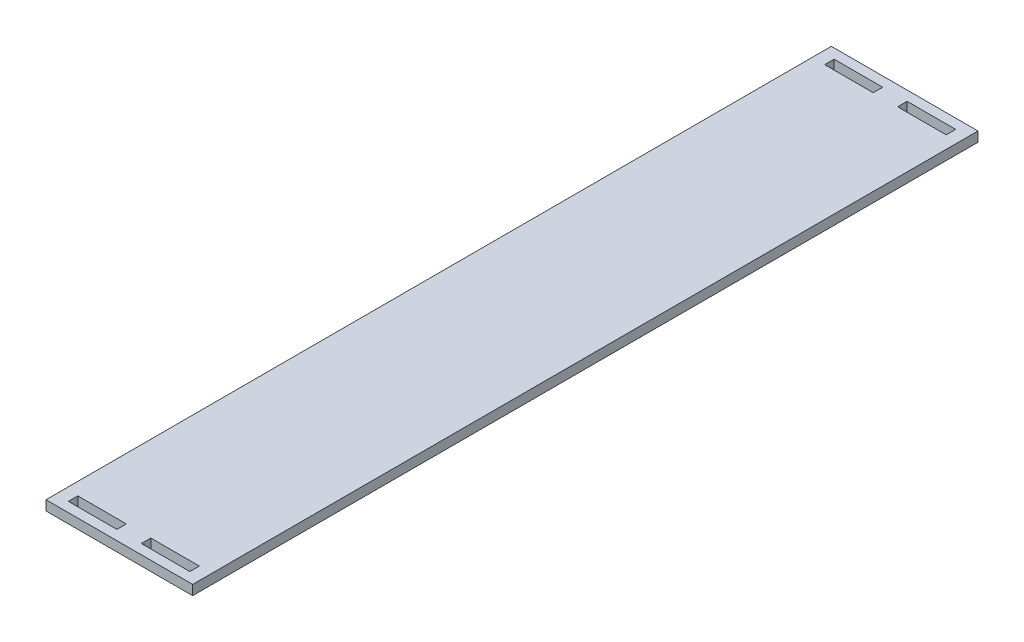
from build123d import *

# Parameters (mm, degrees)
CROQUIS1_W              = 90
CROQUIS1_H              = 482
CROQUIS1_W_2            = 29.8
CROQUIS1_H_2            = 5.8
SALIENTE_EXTRUIR1_DEPTH = 6


with BuildPart() as part:
    # Croquis1 → Saliente-Extruir1 (new body)
    with BuildSketch(Plane(origin=(0, 0, 0), x_dir=(1, 0, 0), z_dir=(0, 1, 0))):
        with Locations((45, 241)):
            Rectangle(CROQUIS1_W, CROQUIS1_H)
        with Locations((22.6, 8.9)):
            Rectangle(CROQUIS1_W_2, CROQUIS1_H_2, mode=Mode.SUBTRACT)
        with Locations((67.4, 8.9)):
            Rectangle(CROQUIS1_W_2, CROQUIS1_H_2, mode=Mode.SUBTRACT)
        with Locations((67.4, 473.1)):
            Rectangle(CROQUIS1_W_2, CROQUIS1_H_2, mode=Mode.SUBTRACT)
        with Locations((22.6, 473.1)):
            Rectangle(CROQUIS1_W_2, CROQUIS1_H_2, mode=Mode.SUBTRACT)
    extrude(amount=SALIENTE_EXTRUIR1_DEPTH)


solid = part.part
